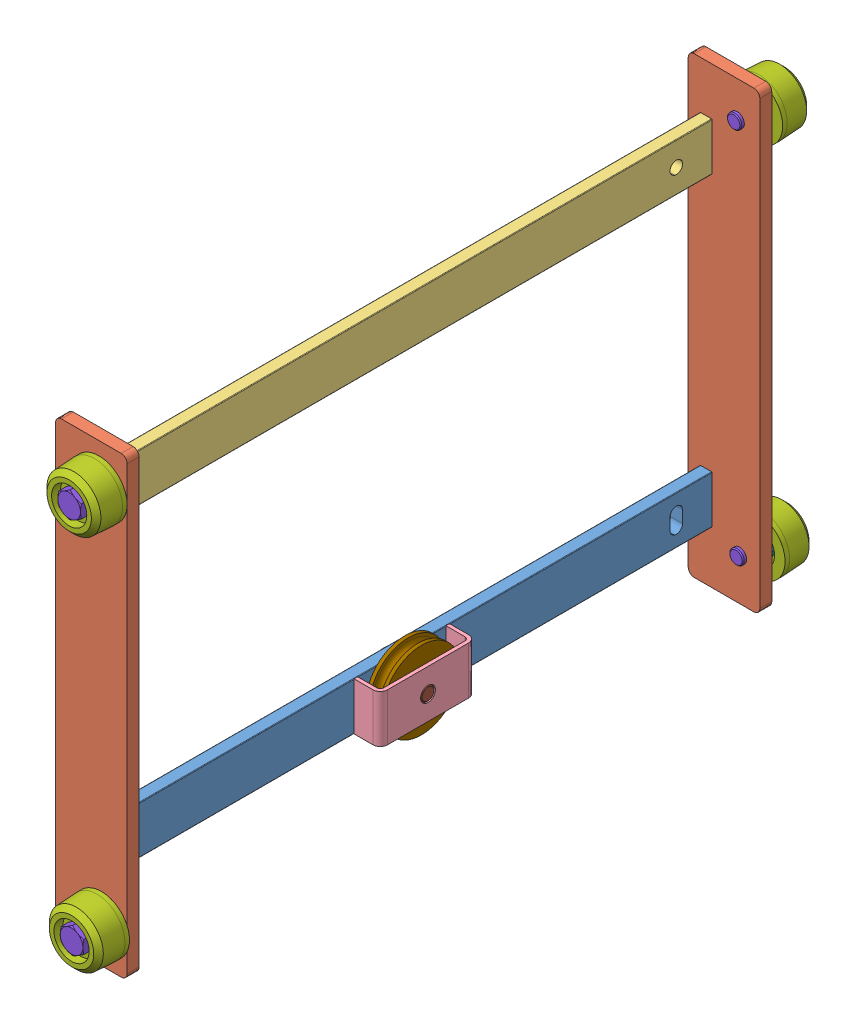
SolidWorks assembly TABLIER COMPLET ASM.sldasm, configuration Défaut (file format 7000). Lengths in mm.
Overall size (656.8 688.27 603.11).
43 component instances, 19 part files, 55 mates.
Components (placement in the parent):
- TABLIER ASM-1: TABLIER ASM.sldasm [Défaut] at (89.8271 104.2639 -234.2326) size (60 380 540)
  - PLAT INF TABLIER-1: PLAT INF TABLIER.SLDPRT [Défaut] at (5.9761 -140.737 -2.4788) x (1 0 0) z (0 1 0) size (10 520 40)
  - TOLE LATERALE TABLIER-3: TOLE LATERALE TABLIER.SLDPRT [Défaut] at (20.9761 -14.737 262.5212) x (1 0 0) z (0 1 0) size (60 10 380)
  - TOLE LATERALE TABLIER-2: TOLE LATERALE TABLIER.SLDPRT [Défaut] at (20.9761 -14.737 -267.4788) x (1 0 0) z (0 1 0) size (60 10 380)
  - PLAT SUP TABLIER-1: PLAT SUP TABLIER.SLDPRT [Défaut] at (5.9761 115.263 -2.4788) x (1 0 0) z (0 -1 0) size (10 520 40)
  - SUPPORT POULIE TABLIER-1: SUPPORT POULIE TABLIER.SLDPRT [Défaut] at (32.9761 -140.737 -2.4788) x (0 0 -1) z (1 0 0) size (80 40 22)
- RONDELLE M12-11: RONDELLE M12.SLDPRT [Défaut] at (123.8032 -65.4731 -509.2114) size (27 27 2.5)
- RONDELLE M12-12: RONDELLE M12.SLDPRT [Défaut] at (121.8032 249.5269 -509.2114) size (27 27 2.5)
- RONDELLE M12-14: RONDELLE M12.SLDPRT [Défaut] at (123.8032 -65.4731 35.7886) x (-1 0 0) z (0 0 -1) size (27 27 2.5)
- RONDELLE M12-13: RONDELLE M12.SLDPRT [Défaut] at (121.8032 249.5269 35.7886) x (-1 0 0) z (0 0 -1) size (27 27 2.5)
- ECROU H12-5: ECROU H12.SLDPRT [Défaut] at (123.8032 -65.4731 -509.2114) size (21.94 19 9.6)
- ECROU H12-7: ECROU H12.SLDPRT [Défaut] at (121.8032 249.5269 -509.2114) size (21.94 19 9.6)
- ECROU H12-6: ECROU H12.SLDPRT [Défaut] at (123.8032 -65.4731 35.7886) x (-1 0 0) z (0 0 -1) size (21.94 19 9.6)
- ECROU H12-4: ECROU H12.SLDPRT [Défaut] at (121.8032 249.5269 35.7886) x (-1 0 0) z (0 0 -1) size (21.94 19 9.6)
- GALET USINE D48-5: GALET USINE D48.SLDPRT [Défaut] at (123.8032 -65.4731 -523.8114) x (0 0 1) z (0 1 0) size (25 47 47)
- GALET USINE D48-6: GALET USINE D48.SLDPRT [Défaut] at (121.8032 249.5269 -523.8114) x (0 0 1) z (0 1 0) size (25 47 47)
- GALET USINE D48-7: GALET USINE D48.SLDPRT [Défaut] at (123.8032 -65.4731 50.3886) x (0 0 -1) z (0 1 0) size (25 47 47)
- GALET USINE D48-4: GALET USINE D48.SLDPRT [Défaut] at (121.8032 249.5269 50.3886) x (0 0 -1) z (0 1 0) size (25 47 47)
- VIS H M12X35-7: VIS H M12X35.SLDPRT [Défaut] at (123.8032 -65.4731 -528.8114) x (-1 0 0) z (0 1 0) size (19 42.5 21.94)
- VIS H M12X35-6: VIS H M12X35.SLDPRT [Défaut] at (121.8032 249.5269 -528.8114) x (-1 0 0) z (0 1 0) size (19 42.5 21.94)
- VIS H M12X35-9: VIS H M12X35.SLDPRT [Défaut] at (123.8032 -65.4731 55.3886) x (1 0 0) z (0 1 0) size (19 42.5 21.94)
- VIS H M12X35-8: VIS H M12X35.SLDPRT [Défaut] at (121.8032 249.5269 55.3886) x (1 0 0) z (0 1 0) size (19 42.5 21.94)
- POULIE DE DIABLE ACIER-1: POULIE DE DIABLE ACIER.SLDPRT [Défaut] at (110.3032 -36.4731 -236.7114) x (0 -1 0) z (0 0 1) size (65 18 65)
- AXE TABLIER ASM-1: AXE TABLIER ASM.sldasm [Défaut] at (90.8032 -36.4731 -236.7114) x (0 0 -1) z (0 -1 0) size (45 37 30)
  - PLATINE AXE TABLIER-1: PLATINE AXE TABLIER.SLDPRT [Défaut] at origin size (45 5 30)
  - ETIRE AXE TABLIER-1: ETIRE AXE TABLIER.SLDPRT [Défaut] at (0 -5 0) x (-1 0 0) z (0 0 1) size (12 37 12)
- RONDELLE M6-2: RONDELLE M6.SLDPRT [Défaut] at (84.6032 -36.4731 -216.7114) x (0 1 0) z (1 0 0) size (14 14 1.2)
- VIS H M6X15-1: VIS H M6X15.SLDPRT [Défaut] at (84.6032 -36.4731 -216.7114) x (0 -1 0) z (0 0 1) size (10 19 11.55)
- FOURCHE ASM-1: FOURCHE ASM.sldasm [Défaut] at (40.9205 -56.1261 -14.9731) x (0 0 1) z (1 0 0) size (40 390 560)
  - PLAT FOURCHE-1: PLAT FOURCHE.SLDPRT [Défaut] at (8.2616 54.347 49.8827) x (0 0 1) z (0 -1 0) size (525 40 390)
  - ACCROCHE FOURCHE-1: ACCROCHE FOURCHE.SLDPRT [Défaut] at (-9.2384 -295.653 49.8827) x (0 0 1) z (0 -1 0) size (35 5 80)
  - ACCROCHE FOURCHE-2: ACCROCHE FOURCHE.SLDPRT [Défaut] at (25.7616 -295.653 49.8827) x (0 0 1) z (0 -1 0) size (35 5 80)
  - BUTEE FOURCHE-1: BUTEE FOURCHE.SLDPRT [Défaut] at (8.2616 -45.653 54.8827) x (0 1 0) z (0 0 -1) size (10 40 10)
- FOURCHE ASM-2: FOURCHE ASM.sldasm [Défaut] at (40.9205 -56.1261 -474.9731) x (0 0 1) z (1 0 0) size (40 390 560)
  - PLAT FOURCHE-1: PLAT FOURCHE.SLDPRT [Défaut] at (8.2616 54.347 49.8827) x (0 0 1) z (0 -1 0) size (525 40 390)
  - ACCROCHE FOURCHE-1: ACCROCHE FOURCHE.SLDPRT [Défaut] at (-9.2384 -295.653 49.8827) x (0 0 1) z (0 -1 0) size (35 5 80)
  - ACCROCHE FOURCHE-2: ACCROCHE FOURCHE.SLDPRT [Défaut] at (25.7616 -295.653 49.8827) x (0 0 1) z (0 -1 0) size (35 5 80)
  - BUTEE FOURCHE-1: BUTEE FOURCHE.SLDPRT [Défaut] at (8.2616 -45.653 54.8827) x (0 1 0) z (0 0 -1) size (10 40 10)
- RONDELLE M10-1: RONDELLE M10.SLDPRT [Défaut] at (102.8032 -35.4731 -466.7114) x (0 0 1) z (-1 0 0) size (22 22 2)
- RONDELLE M10-2: RONDELLE M10.SLDPRT [Défaut] at (102.8032 -35.4731 -6.7114) x (0 0 1) z (-1 0 0) size (22 22 2)
- RONDELLE W10-1: RONDELLE W10.SLDPRT [Défaut] at (-498.4737 -408.6506 -529.2168) x (0.851042 0.005403 0.52507) z (0.006349 -0.99998 0) size (16 16 2.84)
- VIS H M10X25-1: VIS H M10X25.SLDPRT [Défaut] at (102.8032 -35.4731 -466.7114) x (0 0 -1) z (0 1 0) size (17 31.4 19.63)
- VIS H M10X25-2: VIS H M10X25.SLDPRT [Défaut] at (102.8032 -35.4731 -6.7114) x (0 0 -1) z (0 1 0) size (17 31.4 19.63)
Mates (geometry in assembly coordinates):
- Coaxiale1: concentric aligned: cylinder of GALET USINE D48-5 through (123.8032 -65.4731 -511.3114) axis (0 0 -1) radius 6; cylinder of VIS H M12X35-7 through (123.8032 -65.4731 -493.8114) axis (0 0 -1) radius 6
- Coïncidente1: coincident anti-aligned: plane of GALET USINE D48-5 through (130.3031 -65.4731 -528.8114) normal (0 0 -1); plane of VIS H M12X35-7 through (115.1032 -65.4731 -528.8114) normal (0 0 1)
- Coaxiale2: concentric anti-aligned: cylinder of ECROU H12-5 through (123.8032 -65.4731 -509.2114) axis (0 0 1) radius 5.0528; cylinder of VIS H M12X35-7 through (123.8032 -65.4731 -493.8114) axis (0 0 -1) radius 6
- Coïncidente2: coincident anti-aligned: plane of ECROU H12-5 through (123.8032 -65.4731 -518.8114) normal (0 0 -1); plane of GALET USINE D48-5 through (138.5532 -65.4731 -518.8114) normal (0 0 1)
- Coaxiale3: concentric anti-aligned: circle of RONDELLE M12-11; cylinder of VIS H M12X35-7 through (123.8032 -65.4731 -493.8114) axis (0 0 -1) radius 6
- Coïncidente3: coincident anti-aligned: plane of RONDELLE M12-11 through (137.3032 -65.4731 -509.2114) normal (0 0 -1); plane of ECROU H12-5 through (123.8032 -65.4731 -509.2114) normal (0 0 1)
- Coaxiale4: concentric aligned: cylinder of TABLIER ASM-1/TOLE LATERALE TABLIER-2 through (123.8032 -65.4731 -496.7114) axis (0 0 -1) radius 5.1; cylinder of VIS H M12X35-7 through (123.8032 -65.4731 -493.8114) axis (0 0 -1) radius 6
- Coïncidente4: coincident anti-aligned: plane of TABLIER ASM-1/TOLE LATERALE TABLIER-2 through (85.8032 274.5269 -506.7114) normal (0 0 -1); plane of RONDELLE M12-11 through (130.8032 -65.4731 -506.7114) normal (0 0 1)
- Coaxiale5: concentric aligned: cylinder of GALET USINE D48-6 through (121.8032 249.5269 -511.3114) axis (0 0 -1) radius 6; cylinder of VIS H M12X35-6 through (121.8032 249.5269 -493.8114) axis (0 0 -1) radius 6
- Coïncidente5: coincident anti-aligned: plane of GALET USINE D48-6 through (128.3031 249.5269 -528.8114) normal (0 0 -1); plane of VIS H M12X35-6 through (113.1032 249.5269 -528.8114) normal (0 0 1)
- Coaxiale6: concentric anti-aligned: cylinder of ECROU H12-7 through (121.8032 249.5269 -509.2114) axis (0 0 1) radius 5.0528; cylinder of VIS H M12X35-6 through (121.8032 249.5269 -493.8114) axis (0 0 -1) radius 6
- Coïncidente6: coincident anti-aligned: plane of ECROU H12-7 through (121.8032 249.5269 -518.8114) normal (0 0 -1); plane of GALET USINE D48-6 through (136.5532 249.5269 -518.8114) normal (0 0 1)
- Coaxiale7: concentric anti-aligned: cylinder of RONDELLE M12-12 through (121.8032 249.5269 -509.2114) axis (0 0 1) radius 7; cylinder of VIS H M12X35-6 through (121.8032 249.5269 -493.8114) axis (0 0 -1) radius 6
- Coïncidente7: coincident anti-aligned: plane of RONDELLE M12-12 through (135.3032 249.5269 -509.2114) normal (0 0 -1); plane of ECROU H12-7 through (121.8032 249.5269 -509.2114) normal (0 0 1)
- Coaxiale8: concentric aligned: cylinder of TABLIER ASM-1/TOLE LATERALE TABLIER-2 through (121.8032 249.5269 -496.7114) axis (0 0 -1) radius 5.1; cylinder of VIS H M12X35-6 through (121.8032 249.5269 -493.8114) axis (0 0 -1) radius 6
- Coïncidente8: coincident anti-aligned: plane of TABLIER ASM-1/TOLE LATERALE TABLIER-2 through (85.8032 274.5269 -506.7114) normal (0 0 -1); plane of RONDELLE M12-12 through (128.8032 249.5269 -506.7114) normal (0 0 1)
- Coaxiale9: concentric aligned: cylinder of GALET USINE D48-7 through (123.8032 -65.4731 37.8886) axis (0 0 1) radius 6; cylinder of VIS H M12X35-9 through (123.8032 -65.4731 20.3886) axis (0 0 1) radius 6
- Coïncidente9: coincident anti-aligned: plane of GALET USINE D48-7 through (117.3032 -65.4731 55.3886) normal (0 0 1); plane of VIS H M12X35-9 through (132.5032 -65.4731 55.3886) normal (0 0 -1)
- Coaxiale10: concentric anti-aligned: cylinder of ECROU H12-6 through (123.8032 -65.4731 35.7886) axis (0 0 -1) radius 5.0528; cylinder of VIS H M12X35-9 through (123.8032 -65.4731 20.3886) axis (0 0 1) radius 6
- Coïncidente10: coincident anti-aligned: plane of ECROU H12-6 through (123.8032 -65.4731 45.3886) normal (0 0 1); plane of GALET USINE D48-7 through (109.0532 -65.4731 45.3886) normal (0 0 -1)
- Coaxiale11: concentric anti-aligned: cylinder of RONDELLE M12-14 through (123.8032 -65.4731 35.7886) axis (0 0 -1) radius 7; cylinder of VIS H M12X35-9 through (123.8032 -65.4731 20.3886) axis (0 0 1) radius 6
- Coïncidente11: coincident anti-aligned: plane of RONDELLE M12-14 through (110.3032 -65.4731 35.7886) normal (0 0 1); plane of ECROU H12-6 through (123.8032 -65.4731 35.7886) normal (0 0 -1)
- Coaxiale12: concentric anti-aligned: cylinder of TABLIER ASM-1/TOLE LATERALE TABLIER-3 through (123.8032 -65.4731 33.2886) axis (0 0 -1) radius 5.1; cylinder of VIS H M12X35-9 through (123.8032 -65.4731 20.3886) axis (0 0 1) radius 6
- Coïncidente12: coincident anti-aligned: plane of TABLIER ASM-1/TOLE LATERALE TABLIER-3 through (85.8032 274.5269 33.2886) normal (0 0 1); plane of RONDELLE M12-14 through (116.8032 -65.4731 33.2886) normal (0 0 -1)
- Coaxiale13: concentric aligned: cylinder of GALET USINE D48-4 through (121.8032 249.5269 37.8886) axis (0 0 1) radius 6; cylinder of VIS H M12X35-8 through (121.8032 249.5269 20.3886) axis (0 0 1) radius 6
- Coïncidente13: coincident anti-aligned: plane of GALET USINE D48-4 through (115.3032 249.5269 55.3886) normal (0 0 1); plane of VIS H M12X35-8 through (130.5032 249.5269 55.3886) normal (0 0 -1)
- Coaxiale14: concentric anti-aligned: cylinder of ECROU H12-4 through (121.8032 249.5269 35.7886) axis (0 0 -1) radius 5.0528; cylinder of VIS H M12X35-8 through (121.8032 249.5269 20.3886) axis (0 0 1) radius 6
- Coïncidente14: coincident anti-aligned: plane of ECROU H12-4 through (121.8032 249.5269 45.3886) normal (0 0 1); plane of GALET USINE D48-4 through (107.0532 249.5269 45.3886) normal (0 0 -1)
- Coaxiale15: concentric anti-aligned: cylinder of RONDELLE M12-13 through (121.8032 249.5269 35.7886) axis (0 0 -1) radius 7; cylinder of VIS H M12X35-8 through (121.8032 249.5269 20.3886) axis (0 0 1) radius 6
- Coïncidente15: coincident anti-aligned: plane of RONDELLE M12-13 through (108.3032 249.5269 35.7886) normal (0 0 1); plane of ECROU H12-4 through (121.8032 249.5269 35.7886) normal (0 0 -1)
- Coaxiale16: concentric anti-aligned: cylinder of TABLIER ASM-1/TOLE LATERALE TABLIER-3 through (121.8032 249.5269 33.2886) axis (0 0 -1) radius 5.1; cylinder of VIS H M12X35-8 through (121.8032 249.5269 20.3886) axis (0 0 1) radius 6
- Coïncidente16: coincident anti-aligned: plane of TABLIER ASM-1/TOLE LATERALE TABLIER-3 through (85.8032 274.5269 33.2886) normal (0 0 1); plane of RONDELLE M12-13 through (114.8032 249.5269 33.2886) normal (0 0 -1)
- Coaxiale17: concentric aligned: cylinder of TABLIER ASM-1/SUPPORT POULIE TABLIER-1 through (119.8032 -36.4731 -236.7114) axis (-1 0 0) radius 6.25; cylinder of POULIE DE DIABLE ACIER-1 through (119.3032 -36.4731 -236.7114) axis (-1 0 0) radius 6
- Distance1: distance = 0.5 mm anti-aligned: plane of POULIE DE DIABLE ACIER-1 through (101.3032 -42.4731 -236.7114) normal (-1 0 0); plane of TABLIER ASM-1/PLAT INF TABLIER-1 through (100.8032 -36.4731 -236.7114) normal (1 0 0)
- Coaxiale18: concentric aligned: cylinder of TABLIER ASM-1/PLAT INF TABLIER-1 through (100.8032 -36.4731 -236.7114) axis (1 0 0) radius 6.25; cylinder of AXE TABLIER ASM-1/ETIRE AXE TABLIER-1 through (85.8032 -36.4731 -236.7114) axis (1 0 0) radius 6
- Coïncidente18: coincident anti-aligned: plane of TABLIER ASM-1/PLAT INF TABLIER-1 through (90.8032 -36.4731 -236.7114) normal (-1 0 0); plane of AXE TABLIER ASM-1/PLATINE AXE TABLIER-1 through (90.8032 -36.4731 -216.7114) normal (1 0 0)
- Coaxiale19: concentric anti-aligned: cylinder of TABLIER ASM-1/PLAT INF TABLIER-1 through (100.8032 -36.4731 -216.7114) axis (1 0 0) radius 2.5; cylinder of AXE TABLIER ASM-1/PLATINE AXE TABLIER-1 through (90.8032 -36.4731 -216.7114) axis (-1 0 0) radius 3.5
- Coaxiale20: concentric anti-aligned: cylinder of AXE TABLIER ASM-1/PLATINE AXE TABLIER-1 through (90.8032 -36.4731 -216.7114) axis (-1 0 0) radius 3.5; cylinder of RONDELLE M6-2 through (84.6032 -36.4731 -216.7114) axis (1 0 0) radius 3.5
- Coïncidente19: coincident anti-aligned: plane of AXE TABLIER ASM-1/PLATINE AXE TABLIER-1 through (85.8032 -36.4731 -216.7114) normal (-1 0 0); plane of RONDELLE M6-2 through (85.8032 -32.9731 -216.7114) normal (1 0 0)
- Coaxiale21: concentric aligned: cylinder of AXE TABLIER ASM-1/PLATINE AXE TABLIER-1 through (90.8032 -36.4731 -216.7114) axis (-1 0 0) radius 3.5; cylinder of VIS H M6X15-1 through (99.6032 -36.4731 -216.7114) axis (-1 0 0) radius 3
- Coïncidente20: coincident anti-aligned: plane of RONDELLE M6-2 through (84.6032 -29.4731 -216.7114) normal (-1 0 0); plane of VIS H M6X15-1 through (84.6032 -40.9231 -216.7114) normal (1 0 0)
- Coïncidente45: coincident anti-aligned: plane of TABLIER ASM-1/PLAT SUP TABLIER-1 through (100.8032 239.5269 23.2886) normal (0 1 0); plane of FOURCHE ASM-1/ACCROCHE FOURCHE-1 through (101.8032 239.5269 -21.7114) normal (0 -1 0)
- Coïncidente46: coincident anti-aligned: plane of TABLIER ASM-1/PLAT SUP TABLIER-1 through (90.8032 219.5269 -236.7114) normal (-1 0 0); plane of FOURCHE ASM-1/PLAT FOURCHE-1 through (90.8032 279.5269 13.2886) normal (1 0 0)
- Coïncidente51: coincident aligned: line of TABLIER ASM-1/PLAT INF TABLIER-1 through (90.8032 -26.2231 -6.7114) axis (0 -1 0); line of FOURCHE ASM-1/PLAT FOURCHE-1 through (90.8032 -31.2231 -6.7114) axis (0 -1 0)
- Coïncidente52: coincident anti-aligned: plane of TABLIER ASM-1/PLAT SUP TABLIER-1 through (100.8032 239.5269 23.2886) normal (0 1 0); plane of FOURCHE ASM-2/ACCROCHE FOURCHE-1 through (101.8032 239.5269 -481.7114) normal (0 -1 0)
- Coïncidente53: coincident anti-aligned: plane of TABLIER ASM-1/PLAT SUP TABLIER-1 through (90.8032 219.5269 -236.7114) normal (-1 0 0); plane of FOURCHE ASM-2/PLAT FOURCHE-1 through (90.8032 279.5269 -446.7114) normal (1 0 0)
- Coïncidente54: coincident aligned: line of TABLIER ASM-1/PLAT INF TABLIER-1 through (90.8032 -26.2231 -466.7114) axis (0 -1 0); line of FOURCHE ASM-2/PLAT FOURCHE-1 through (90.8032 -31.2231 -466.7114) axis (0 -1 0)
- Coaxiale61: concentric anti-aligned: cylinder of RONDELLE M10-1 through (102.8032 -35.4731 -466.7114) axis (-1 0 0) radius 5.5; cylinder of VIS H M10X25-1 through (77.8032 -35.4731 -466.7114) axis (1 0 0) radius 5
- Coïncidente85: coincident anti-aligned: plane of RONDELLE M10-1 through (102.8032 -35.4731 -455.7114) normal (1 0 0); plane of VIS H M10X25-1 through (102.8032 -35.4731 -474.5114) normal (-1 0 0)
- Coïncidente86: coincident anti-aligned: plane of TABLIER ASM-1/PLAT INF TABLIER-1 through (100.8032 -36.4731 -236.7114) normal (1 0 0); plane of RONDELLE M10-1 through (100.8032 -35.4731 -461.2114) normal (-1 0 0)
- Coaxiale59: concentric anti-aligned: cylinder of RONDELLE M10-2 through (102.8032 -35.4731 -6.7114) axis (-1 0 0) radius 5.5; cylinder of VIS H M10X25-2 through (77.8032 -35.4731 -6.7114) axis (1 0 0) radius 5
- Coïncidente83: coincident anti-aligned: plane of RONDELLE M10-2 through (102.8032 -35.4731 4.2886) normal (1 0 0); plane of VIS H M10X25-2 through (102.8032 -35.4731 -14.5114) normal (-1 0 0)
- Coïncidente84: coincident anti-aligned: plane of TABLIER ASM-1/PLAT INF TABLIER-1 through (100.8032 -36.4731 -236.7114) normal (1 0 0); plane of RONDELLE M10-2 through (100.8032 -35.4731 -1.2114) normal (-1 0 0)
- Coaxiale99: concentric anti-aligned: cylinder of FOURCHE ASM-2/PLAT FOURCHE-1 through (75.8032 -35.4731 -466.7114) axis (-1 0 0) radius 4.25; cylinder of VIS H M10X25-1 through (77.8032 -35.4731 -466.7114) axis (1 0 0) radius 5
- Coaxiale98: concentric anti-aligned: cone of FOURCHE ASM-1/PLAT FOURCHE-1 through (90.8032 -35.4731 -6.7114) axis (-1 0 0); cylinder of VIS H M10X25-2 through (77.8032 -35.4731 -6.7114) axis (1 0 0) radius 5
